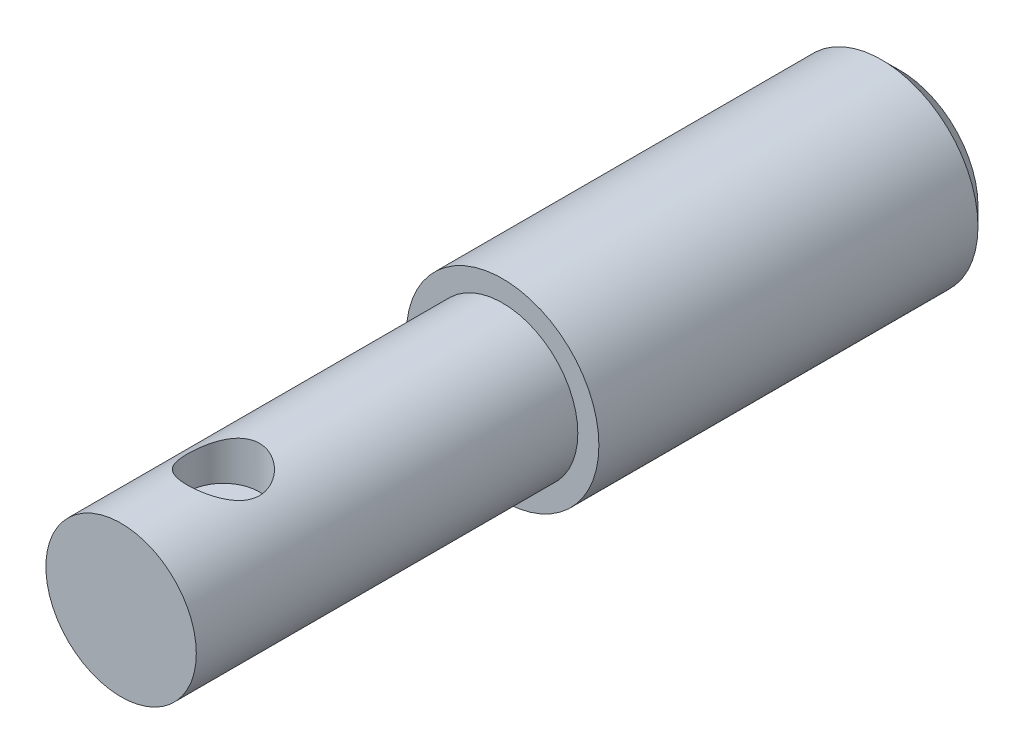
from build123d import *

# Parameters (mm, degrees)
SKETCH1_R                    = 4
BOSS_EXTRUDE1_DEPTH          = 16.5
SKETCH2_R                    = 3.125
BOSS_EXTRUDE2_DEPTH          = 15.85
CHAMFER1_SIZE                = 0.75
F_3_0_3_DIAMETER_HOLE2_D     = 3
F_3_0_3_DIAMETER_HOLE2_DEPTH = 1.75


with BuildPart() as part:
    # Sketch1 → Boss-Extrude1 (new body)
    with BuildSketch(Plane.XY):
        Circle(SKETCH1_R)
    extrude(amount=BOSS_EXTRUDE1_DEPTH)

    # Sketch2 → Boss-Extrude2 (add)
    with BuildSketch(Plane.XY.offset(16.5)):
        Circle(SKETCH2_R)
    extrude(amount=BOSS_EXTRUDE2_DEPTH)

    # Chamfer1
    chamfer1_edges = [part.edges().sort_by_distance(p)[0] for p in [
        (-4, 0, 0),
    ]]
    chamfer(chamfer1_edges, length=CHAMFER1_SIZE)

    # 3.0 _3_ Diameter Hole2
    with Locations(Plane(origin=(0, 3.125, 0), x_dir=(1, 0, 0), z_dir=(0, 1, 0))):
        with Locations((0, -28.1)):
            Hole(F_3_0_3_DIAMETER_HOLE2_D / 2, depth=F_3_0_3_DIAMETER_HOLE2_DEPTH)


solid = part.part
